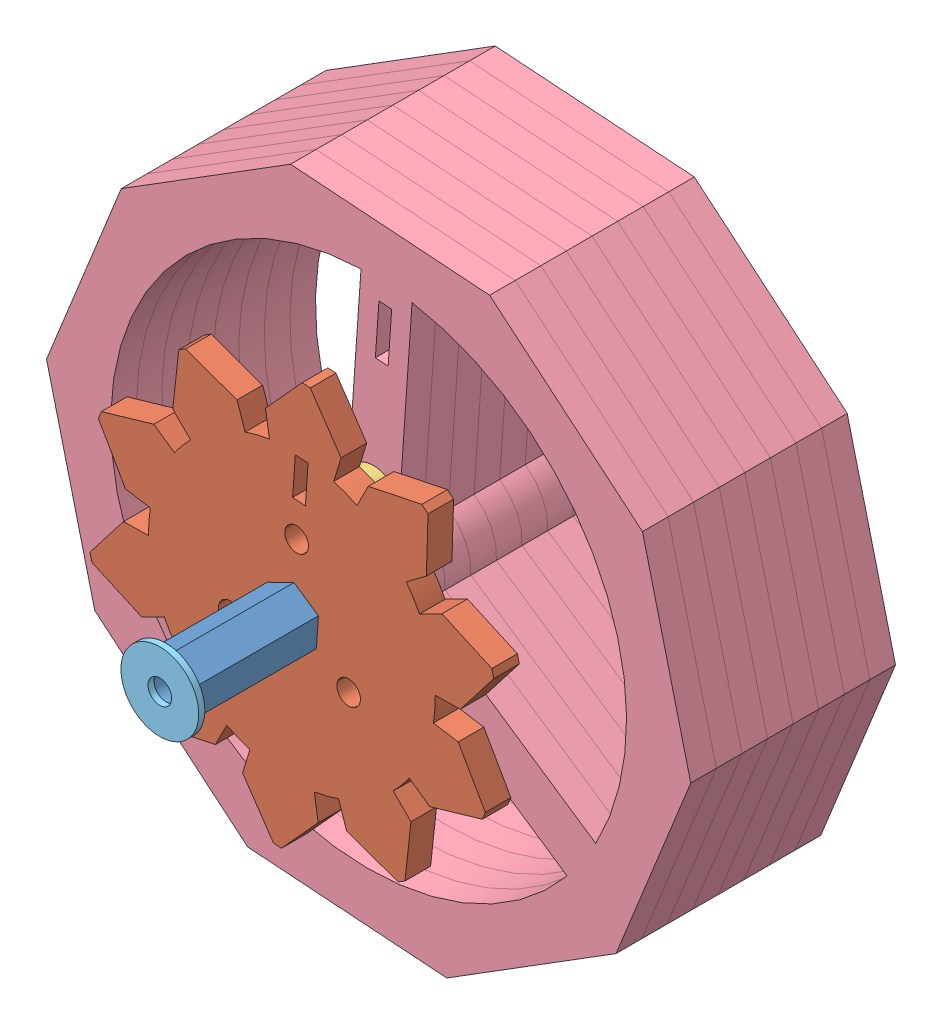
SolidWorks assembly Readout.SLDASM, configuration Default (file format 7000). Lengths in mm.
Overall size (85.24 81.6 65.02).
15 component instances, 5 part files, 26 mates.
Components (placement in the parent):
- Standoff-2p5in-1s4-3: Standoff-2p5in-1s4.SLDPRT [Default] at (-51.5451 71.035 -5.9896) x (0.829038 -0.559193 0) z (-0.559193 -0.829038 0) size (7.33 63.5 6.35)
- ReadoutGear-1: ReadoutGear.SLDPRT [Default] at (-51.5451 71.035 38.7169) x (0.997564 -0.069756 0) z (0 0 1) size (49.17 51.37 3.17)
- Spacer-0p25-1s4-4: Spacer-0p25-1s4.SLDPRT [Default] at (-59.1849 67.3088 32.3669) size (6.35 6.35 6.35)
- Spacer-0p25-1s4-5: Spacer-0p25-1s4.SLDPRT [Default] at (-44.4983 66.2819 32.3669) size (6.35 6.35 6.35)
- Spacer-0p25-1s4-6: Spacer-0p25-1s4.SLDPRT [Default] at (-50.9522 79.5143 32.3669) size (6.35 6.35 6.35)
- ReadoutCylinder-1: ReadoutCylinder.SLDPRT [Default] at (-51.5451 71.035 29.1919) x (0.997564 -0.069756 0) z (0 0 1) size (80.12 76.2 3.17)
- ReadoutCylinder-2: ReadoutCylinder.SLDPRT [Default] at (-51.5451 71.035 26.0169) x (0.997564 -0.069756 0) z (0 0 1) size (80.12 76.2 3.17)
- ReadoutCylinder-3: ReadoutCylinder.SLDPRT [Default] at (-51.5451 71.035 22.8419) x (0.997564 -0.069756 0) z (0 0 1) size (80.12 76.2 3.17)
- ReadoutCylinder-4: ReadoutCylinder.SLDPRT [Default] at (-51.5451 71.035 19.6669) x (0.997564 -0.069756 0) z (0 0 1) size (80.12 76.2 3.17)
- ReadoutCylinder-5: ReadoutCylinder.SLDPRT [Default] at (-51.5451 71.035 16.4919) x (0.997564 -0.069756 0) z (0 0 1) size (80.12 76.2 3.17)
- ReadoutCylinder-6: ReadoutCylinder.SLDPRT [Default] at (-51.5451 71.035 13.3169) x (0.997564 -0.069756 0) z (0 0 1) size (80.12 76.2 3.17)
- ReadoutCylinder-7: ReadoutCylinder.SLDPRT [Default] at (-51.5451 71.035 10.1419) x (0.997564 -0.069756 0) z (0 0 1) size (80.12 76.2 3.17)
- ReadoutCylinder-8: ReadoutCylinder.SLDPRT [Default] at (-51.5451 71.035 6.9669) x (0.997564 -0.069756 0) z (0 0 1) size (80.12 76.2 3.17)
- Washer-0p38in-1: Washer-0p38in.SLDPRT [Default] at (-51.5451 71.035 57.5104) x (0.999237 0.039047 0) z (0 0 1) size (9.65 9.65 0.76)
- Washer-0p38in-2: Washer-0p38in.SLDPRT [Default] at (-51.5451 71.035 -6.7516) size (9.65 9.65 0.76)
Mates (geometry in assembly coordinates):
- Coincident2: coincident anti-aligned: plane of ReadoutGear-1 through (-54.5845 73.0851 41.8919) normal (0.997564 -0.069756 0); plane of Standoff-2p5in-1s4-3 through (-54.5845 73.0851 57.5104) normal (-0.997564 0.069756 0)
- Coincident3: coincident anti-aligned: plane of ReadoutGear-1 through (-54.8403 69.4279 41.8919) normal (0.559193 0.829038 0); plane of Standoff-2p5in-1s4-3 through (-54.8403 69.4279 57.5104) normal (-0.559193 -0.829038 0)
- Coincident10: coincident anti-aligned: plane of ReadoutCylinder-2 through (-48.5057 68.9849 29.1919) normal (-0.997564 0.069756 0); plane of Standoff-2p5in-1s4-3 through (-48.5057 68.9849 57.5104) normal (0.997564 -0.069756 0)
- Coincident11: coincident anti-aligned: plane of ReadoutCylinder-2 through (-48.25 72.6421 29.1919) normal (-0.559193 -0.829038 0); plane of Standoff-2p5in-1s4-3 through (-48.25 72.6421 57.5104) normal (0.559193 0.829038 0)
- Coincident12: coincident aligned: circle of ReadoutCylinder-1; circle of ReadoutCylinder-2
- Coincident13: coincident aligned: circle of ReadoutCylinder-2; circle of ReadoutCylinder-3
- Coincident14: coincident aligned: circle of ReadoutCylinder-2; circle of ReadoutCylinder-3
- Coincident15: coincident aligned: circle of ReadoutCylinder-3; circle of ReadoutCylinder-4
- Coincident17: coincident aligned: circle of ReadoutCylinder-3; circle of ReadoutCylinder-4
- Coincident18: coincident aligned: circle of ReadoutCylinder-1; circle of Spacer-0p25-1s4-5
- Coincident19: coincident aligned: circle of ReadoutCylinder-1; circle of Spacer-0p25-1s4-6
- Coincident20: coincident aligned: circle of ReadoutCylinder-1; circle of Spacer-0p25-1s4-4
- Coincident21: coincident aligned: circle of ReadoutGear-1; circle of Spacer-0p25-1s4-6
- Coincident22: coincident aligned: circle of ReadoutGear-1; circle of Spacer-0p25-1s4-5
- Coincident29: coincident aligned: circle of ReadoutCylinder-7; circle of ReadoutCylinder-8
- Coincident30: coincident aligned: circle of ReadoutCylinder-7; circle of ReadoutCylinder-8
- Coincident31: coincident aligned: circle of ReadoutCylinder-6; circle of ReadoutCylinder-7
- Coincident32: coincident aligned: circle of ReadoutCylinder-6; circle of ReadoutCylinder-7
- Coincident33: coincident aligned: circle of ReadoutCylinder-5; circle of ReadoutCylinder-6
- Coincident34: coincident aligned: circle of ReadoutCylinder-5; circle of ReadoutCylinder-6
- Coincident35: coincident aligned: circle of ReadoutCylinder-4; circle of ReadoutCylinder-5
- Coincident36: coincident aligned: circle of ReadoutCylinder-4; circle of ReadoutCylinder-5
- Concentric1: concentric aligned: circle of Standoff-2p5in-1s4-3; circle of Washer-0p38in-1
- Coincident37: coincident anti-aligned: plane of Standoff-2p5in-1s4-3 through (-51.5451 71.035 57.5104) normal (0 0 1); plane of Washer-0p38in-1 through (-51.5451 71.035 57.5104) normal (0 0 -1)
- Concentric2: concentric aligned: circle of Standoff-2p5in-1s4-3; circle of Washer-0p38in-2
- Coincident38: coincident anti-aligned: plane of Standoff-2p5in-1s4-3 through (-51.5451 71.035 -5.9896) normal (0 0 -1); plane of Washer-0p38in-2 through (-51.5451 71.035 -5.9896) normal (0 0 1)
